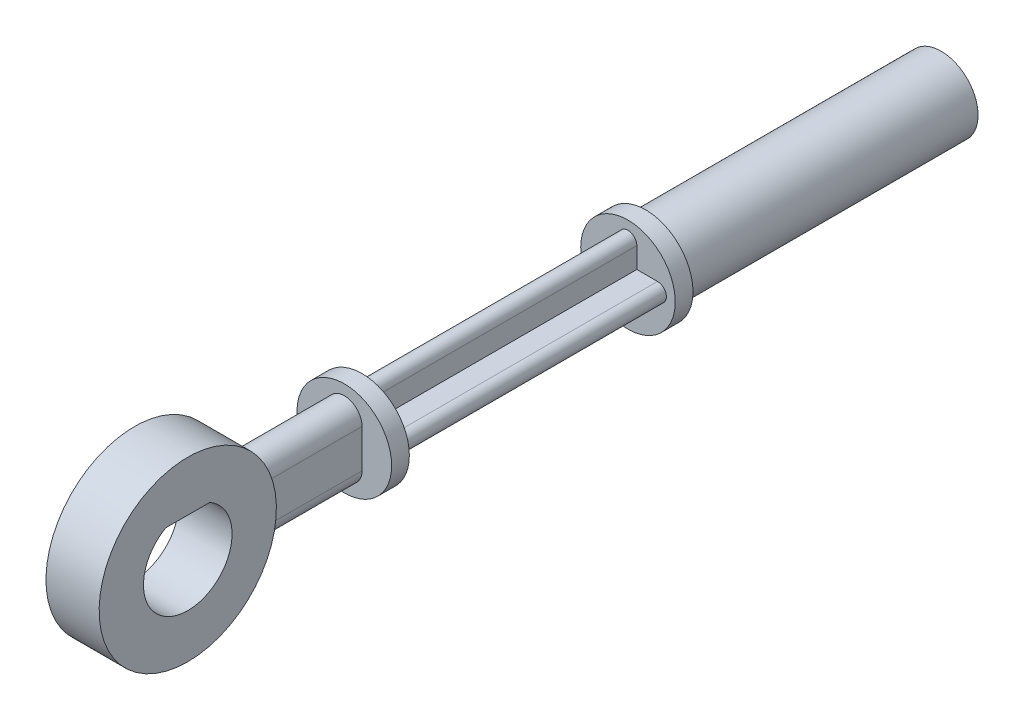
from build123d import *

# Parameters (mm, degrees)
SKETCH1_R           = 16
BASE_EXTRUDE_DEPTH  = 3
EXTRUDE3_DEPTH      = 62
BOSS_EXTRUDE1_DEPTH = 90
SKETCH6_R           = 16
BOSS_EXTRUDE2_DEPTH = 6
SKETCH9_W           = 18
SKETCH9_H           = 30
CUT_EXTRUDE1_DEPTH  = 107.423681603
SKETCH7_R           = 12.5
EXTRUDE4_DEPTH      = 100


with BuildPart() as part:
    # Sketch1 → Base-Extrude (new, symmetric)
    with BuildSketch(Plane.XY):
        Circle(SKETCH1_R)
    extrude(amount=BASE_EXTRUDE_DEPTH, both=True)

    # Sketch2 → Extrude3 (add)
    with BuildSketch(Plane.XY.offset(3)):
        with BuildLine():
            Line((-6, -6.5), (-6, 6.5))
            ThreePointArc((-6, 6.5), (0, 12.5), (6, 6.5))
            Line((6, 6.5), (6, -6.5))
            ThreePointArc((6, -6.5), (0, -12.5), (-6, -6.5))
        make_face()
    extrude(amount=EXTRUDE3_DEPTH)

    # Sketch5 → Boss-Extrude1 (add)
    with BuildSketch(Plane(origin=(0, 0, -3), x_dir=(-1, 0, 0), z_dir=(0, 0, -1))):
        with BuildLine():
            Line((-3, 3), (-3, 10))
            ThreePointArc((-3, 10), (0, 13), (3, 10))
            Line((3, 10), (3, 3))
            Line((3, 3), (10, 3))
            ThreePointArc((10, 3), (13, 0), (10, -3))
            Line((10, -3), (3, -3))
            Line((3, -3), (3, -10))
            ThreePointArc((3, -10), (0, -13), (-3, -10))
            Line((-3, -10), (-3, -3))
            Line((-3, -3), (-10, -3))
            ThreePointArc((-10, -3), (-13, 0), (-10, 3))
            Line((-10, 3), (-3, 3))
        make_face()
    extrude(amount=BOSS_EXTRUDE1_DEPTH)

    # Sketch6 → Boss-Extrude2 (add)
    with BuildSketch(Plane(origin=(0, 0, -93), x_dir=(-1, 0, 0), z_dir=(0, 0, -1))):
        with Locations(Location((0, 0, 0), (0, 0, 180))):
            Circle(SKETCH6_R)
    extrude(amount=BOSS_EXTRUDE2_DEPTH)

    # Sketch9 → Boss-Revolve1 (revolve)
    with BuildSketch(Plane.XY.offset(65), mode=Mode.PRIVATE) as boss_revolve1_sk:
        with Locations((0, 15)):
            Rectangle(SKETCH9_W, SKETCH9_H)
    revolve(boss_revolve1_sk.sketch.rotate(Axis((9, 0, 65), (1, 0, 0)), 180), axis=Axis((9, 0, 65), (1, 0, 0)))

    # Sketch10 → Cut-Extrude1 (cut, through all)
    with BuildSketch(Plane(origin=(9, 0, 0), x_dir=(0, 0, -1), z_dir=(1, 0, 0))):
        with BuildLine():
            Line((-72.483314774, 13), (-57.516685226, 13))
            ThreePointArc((-57.516685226, 13), (-65, -15), (-72.483314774, 13))
        make_face()
    extrude(amount=-CUT_EXTRUDE1_DEPTH, mode=Mode.SUBTRACT)

    # Sketch7 → Extrude4 (add)
    with BuildSketch(Plane(origin=(0, 0, -99), x_dir=(-1, 0, 0), z_dir=(0, 0, -1))):
        Circle(SKETCH7_R)
    extrude(amount=EXTRUDE4_DEPTH)


solid = part.part
